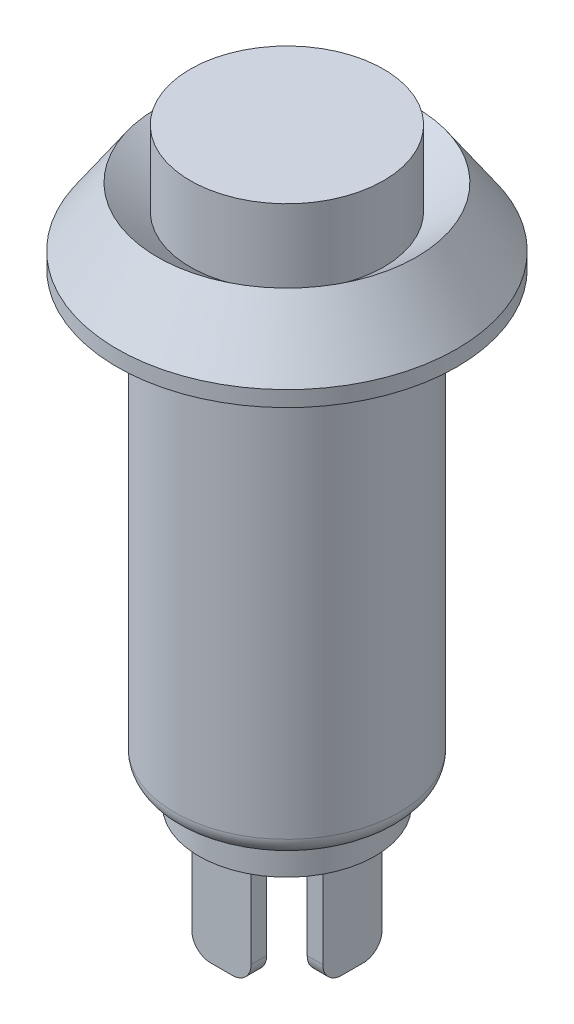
from build123d import *

# Parameters (mm, degrees)
ESQUISSE2_R        = 2.825
BOSS_EXTRU_1_DEPTH = 1
ESQUISSE3_W        = 1.9
ESQUISSE3_H        = 0.5
ESQUISSE3_W_2      = 0.5
ESQUISSE3_H_2      = 1.9
BOSS_EXTRU_2_DEPTH = 3.5
CONG_1_R           = 0.6
CONG_2_R           = 0.6


with BuildPart() as part:
    # Esquisse1 → R_volution1 (revolve)
    with BuildSketch(Plane.XY):
        Polygon((0, 0), (3.1, 0), (3.1, -2.4), (4.15, -1.6), (5.45, -3.5), (5.45, -4), (3.6, -4), (3.6, -17.9), (0, -17.9), align=None)
    revolve(axis=Axis((0, -17.9, 0), (0, 1, 0)))

    # Esquisse2 → Boss.-Extru.1 (add)
    with BuildSketch(Plane.XZ.offset(17.9)):
        Circle(ESQUISSE2_R)
    extrude(amount=BOSS_EXTRU_1_DEPTH)

    # Esquisse3 → Boss.-Extru.2 (add)
    with BuildSketch(Plane.XZ.offset(18.9)):
        with Locations((0, 1.85)):
            Rectangle(ESQUISSE3_W, ESQUISSE3_H)
        with Locations((1.85, 0)):
            Rectangle(ESQUISSE3_W_2, ESQUISSE3_H_2)
        with Locations((0, -1.85)):
            Rectangle(ESQUISSE3_W, ESQUISSE3_H)
        with Locations((-1.85, 0)):
            Rectangle(ESQUISSE3_W_2, ESQUISSE3_H_2)
    extrude(amount=BOSS_EXTRU_2_DEPTH)

    # Cong_1
    cong_1_edges = [part.edges().sort_by_distance(p)[0] for p in [
        (0.95, -22.4, 1.85),
        (-0.95, -22.4, 1.85),
        (1.85, -22.4, -0.95),
        (1.85, -22.4, 0.95),
        (-0.95, -22.4, -1.85),
        (0.95, -22.4, -1.85),
        (-1.85, -22.4, 0.95),
        (-1.85, -22.4, -0.95),
    ]]
    fillet(cong_1_edges, radius=CONG_1_R)

    # Cong_2
    cong_2_edges = [part.edges().sort_by_distance(p)[0] for p in [
        (-3.6, -17.9, 0),
    ]]
    fillet(cong_2_edges, radius=CONG_2_R)


solid = part.part
